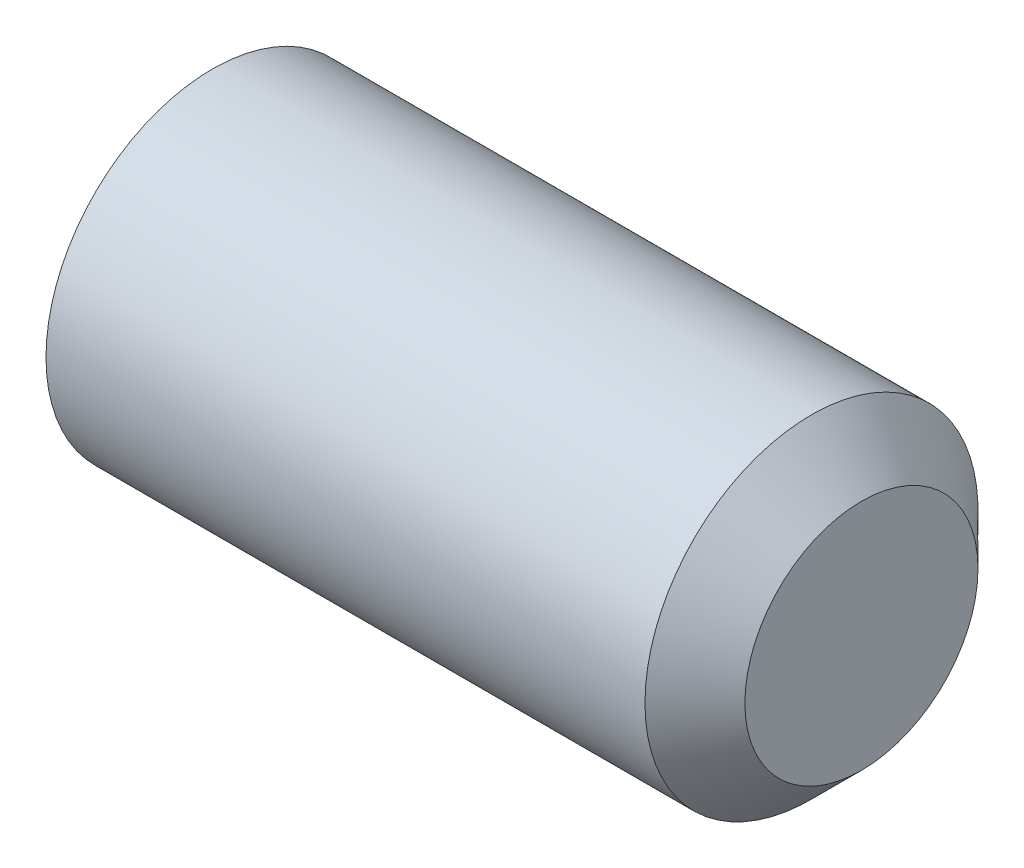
from build123d import *

# Parameters (mm, degrees)
HEX_2_DEPTH = 3


with BuildPart() as part:
    # BodySke → BaseBody (revolve)
    with BuildSketch(Plane.XY, mode=Mode.PRIVATE) as basebody_sk:
        Polygon((0, 0), (0, 2.055), (0.25692087, 2.5), (9.25, 2.5), (10, 1.75), (10, 0), align=None)
    revolve(basebody_sk.sketch.rotate(Axis((-12.7, 0, 0), (1, 0, 0)), 90), axis=Axis((-12.7, 0, 0), (1, 0, 0)))

    # Sketch2 → Hex 2 (cut)
    with BuildSketch(Plane.ZY):
        Polygon((0.721687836, 1.25), (-0.721687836, 1.25), (-1.443375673, 0), (-0.721687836, -1.25), (0.721687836, -1.25), (1.443375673, 0), align=None)
    extrude(amount=-HEX_2_DEPTH, mode=Mode.SUBTRACT)


solid = part.part
